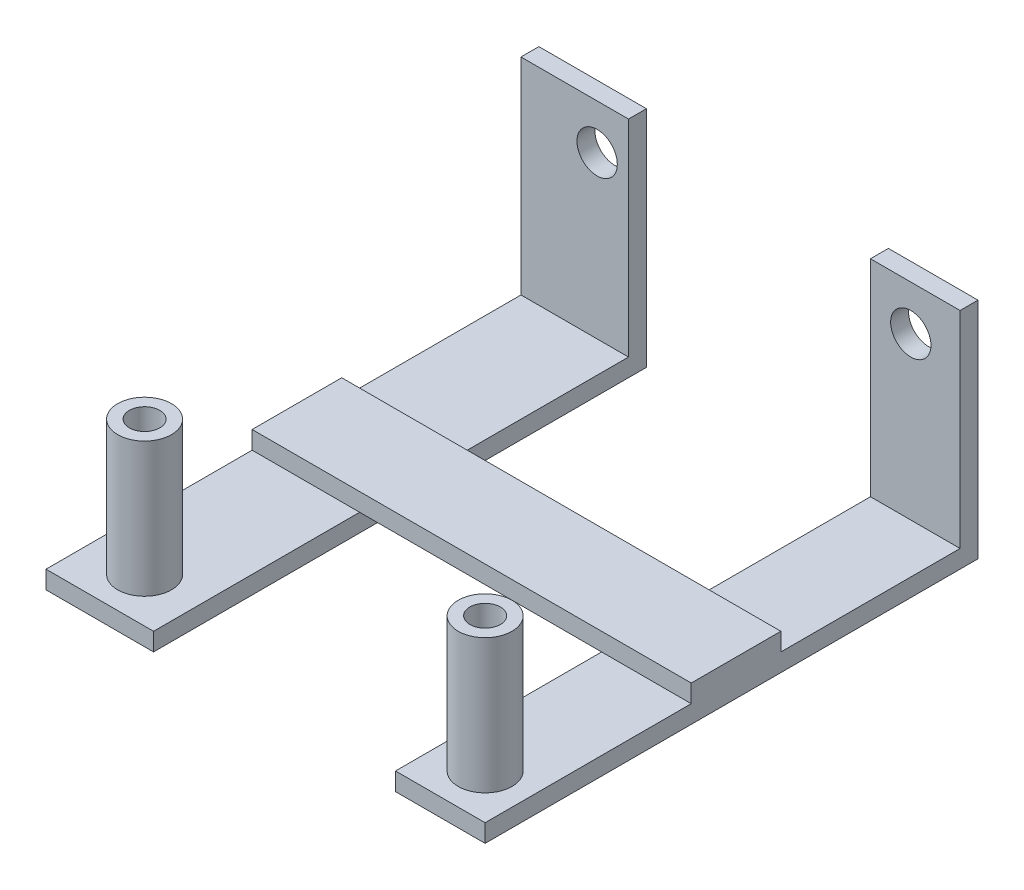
ISO-10303-21;
HEADER;
FILE_DESCRIPTION(('STEP AP214'),'2;1');
FILE_NAME('part.step','',(''),(''),'','','');
FILE_SCHEMA(('AUTOMOTIVE_DESIGN { 1 0 10303 214 1 1 1 1 }'));
ENDSEC;
DATA;
#1=APPLICATION_CONTEXT('core data for automotive mechanical design processes');
#2=APPLICATION_PROTOCOL_DEFINITION('international standard','automotive_design',2000,#1);
#3=PRODUCT_CONTEXT('',#1,'mechanical');
#4=PRODUCT('Part','Part','',(#3));
#5=PRODUCT_RELATED_PRODUCT_CATEGORY('part','',(#4));
#6=PRODUCT_DEFINITION_FORMATION('','',#4);
#7=PRODUCT_DEFINITION_CONTEXT('part definition',#1,'design');
#8=PRODUCT_DEFINITION('design','',#6,#7);
#9=PRODUCT_DEFINITION_SHAPE('','',#8);
#10=(LENGTH_UNIT() NAMED_UNIT(*) SI_UNIT(.MILLI.,.METRE.));
#11=(NAMED_UNIT(*) PLANE_ANGLE_UNIT() SI_UNIT($,.RADIAN.));
#12=(NAMED_UNIT(*) SI_UNIT($,.STERADIAN.) SOLID_ANGLE_UNIT());
#13=UNCERTAINTY_MEASURE_WITH_UNIT(LENGTH_MEASURE(1.E-05),#10,'distance_accuracy_value','');
#14=(GEOMETRIC_REPRESENTATION_CONTEXT(3) GLOBAL_UNCERTAINTY_ASSIGNED_CONTEXT((#13)) GLOBAL_UNIT_ASSIGNED_CONTEXT((#10,
#11,#12)) REPRESENTATION_CONTEXT('',''));
#15=CARTESIAN_POINT('',(0.,0.,0.));
#16=DIRECTION('',(0.,0.,1.));
#17=DIRECTION('',(1.,0.,0.));
#18=AXIS2_PLACEMENT_3D('',#15,#16,#17);
#19=CARTESIAN_POINT('',(0.,0.,0.));
#20=DIRECTION('',(0.,1.,0.));
#21=DIRECTION('',(0.,0.,1.));
#22=AXIS2_PLACEMENT_3D('',#19,#20,#21);
#23=PLANE('',#22);
#24=DIRECTION('',(0.,0.,-1.));
#25=VECTOR('',#24,1.);
#26=CARTESIAN_POINT('',(13.,0.,5.));
#27=LINE('',#26,#25);
#28=CARTESIAN_POINT('',(13.,0.,-18.));
#29=VERTEX_POINT('',#28);
#30=CARTESIAN_POINT('',(13.,0.,-28.));
#31=VERTEX_POINT('',#30);
#32=EDGE_CURVE('E52',#29,#31,#27,.T.);
#33=ORIENTED_EDGE('',*,*,#32,.F.);
#34=DIRECTION('',(1.,0.,0.));
#35=VECTOR('',#34,1.);
#36=CARTESIAN_POINT('',(-26.,0.,-18.));
#37=LINE('',#36,#35);
#38=CARTESIAN_POINT('',(-14.,0.,-18.));
#39=VERTEX_POINT('',#38);
#40=EDGE_CURVE('E235',#39,#29,#37,.T.);
#41=ORIENTED_EDGE('',*,*,#40,.F.);
#42=DIRECTION('',(0.,0.,1.));
#43=VECTOR('',#42,1.);
#44=CARTESIAN_POINT('',(-14.,0.,5.));
#45=LINE('',#44,#43);
#46=CARTESIAN_POINT('',(-14.,0.,-28.));
#47=VERTEX_POINT('',#46);
#48=EDGE_CURVE('E316',#47,#39,#45,.T.);
#49=ORIENTED_EDGE('',*,*,#48,.F.);
#50=DIRECTION('',(-1.,0.,0.));
#51=VECTOR('',#50,1.);
#52=CARTESIAN_POINT('',(-26.,0.,-28.));
#53=LINE('',#52,#51);
#54=EDGE_CURVE('E250',#31,#47,#53,.T.);
#55=ORIENTED_EDGE('',*,*,#54,.F.);
#56=EDGE_LOOP('',(#33,#41,#49,#55));
#57=FACE_BOUND('',#56,.T.);
#58=ADVANCED_FACE('F37',(#57),#23,.F.);
#59=CARTESIAN_POINT('',(0.,0.,0.));
#60=DIRECTION('',(0.,-1.,0.));
#61=DIRECTION('',(0.,0.,-1.));
#62=AXIS2_PLACEMENT_3D('',#59,#60,#61);
#63=PLANE('',#62);
#64=CARTESIAN_POINT('',(-20.,0.,0.));
#65=DIRECTION('',(0.,1.,0.));
#66=DIRECTION('',(0.,0.,1.));
#67=AXIS2_PLACEMENT_3D('',#64,#65,#66);
#68=CIRCLE('',#67,3.);
#69=CARTESIAN_POINT('',(-20.,0.,3.));
#70=VERTEX_POINT('',#69);
#71=EDGE_CURVE('E323',#70,#70,#68,.T.);
#72=ORIENTED_EDGE('',*,*,#71,.F.);
#73=EDGE_LOOP('',(#72));
#74=FACE_BOUND('',#73,.T.);
#75=CARTESIAN_POINT('',(-26.,0.,-18.));
#76=VERTEX_POINT('',#75);
#77=EDGE_CURVE('E247',#76,#39,#37,.T.);
#78=ORIENTED_EDGE('',*,*,#77,.F.);
#79=DIRECTION('',(0.,0.,-1.));
#80=VECTOR('',#79,1.);
#81=CARTESIAN_POINT('',(-26.,0.,5.));
#82=LINE('',#81,#80);
#83=CARTESIAN_POINT('',(-26.,0.,5.));
#84=VERTEX_POINT('',#83);
#85=EDGE_CURVE('E307',#84,#76,#82,.T.);
#86=ORIENTED_EDGE('',*,*,#85,.F.);
#87=DIRECTION('',(-1.,0.,0.));
#88=VECTOR('',#87,1.);
#89=CARTESIAN_POINT('',(-26.,0.,5.));
#90=LINE('',#89,#88);
#91=CARTESIAN_POINT('',(-14.,0.,5.));
#92=VERTEX_POINT('',#91);
#93=EDGE_CURVE('E302',#92,#84,#90,.T.);
#94=ORIENTED_EDGE('',*,*,#93,.F.);
#95=EDGE_CURVE('E60',#39,#92,#45,.T.);
#96=ORIENTED_EDGE('',*,*,#95,.F.);
#97=EDGE_LOOP('',(#78,#86,#94,#96));
#98=FACE_BOUND('',#97,.T.);
#99=ADVANCED_FACE('F329',(#74,#98),#63,.F.);
#100=DIRECTION('',(-1.,0.,0.));
#101=VECTOR('',#100,1.);
#102=CARTESIAN_POINT('',(0.,0.,-28.));
#103=LINE('',#102,#101);
#104=CARTESIAN_POINT('',(-26.,0.,-28.));
#105=VERTEX_POINT('',#104);
#106=EDGE_CURVE('E11',#47,#105,#103,.T.);
#107=ORIENTED_EDGE('',*,*,#106,.F.);
#108=CARTESIAN_POINT('',(-14.,0.,-48.));
#109=VERTEX_POINT('',#108);
#110=EDGE_CURVE('E313',#109,#47,#45,.T.);
#111=ORIENTED_EDGE('',*,*,#110,.F.);
#112=DIRECTION('',(1.,0.,0.));
#113=VECTOR('',#112,1.);
#114=CARTESIAN_POINT('',(-26.,0.,-48.));
#115=LINE('',#114,#113);
#116=CARTESIAN_POINT('',(-26.,0.,-48.));
#117=VERTEX_POINT('',#116);
#118=EDGE_CURVE('E310',#117,#109,#115,.T.);
#119=ORIENTED_EDGE('',*,*,#118,.F.);
#120=EDGE_CURVE('E290',#105,#117,#82,.T.);
#121=ORIENTED_EDGE('',*,*,#120,.F.);
#122=EDGE_LOOP('',(#107,#111,#119,#121));
#123=FACE_BOUND('',#122,.T.);
#124=ADVANCED_FACE('F331',(#123),#63,.F.);
#125=CARTESIAN_POINT('',(0.,0.,-50.));
#126=DIRECTION('',(0.,0.,1.));
#127=DIRECTION('',(1.,0.,0.));
#128=AXIS2_PLACEMENT_3D('',#125,#126,#127);
#129=PLANE('',#128);
#130=DIRECTION('',(0.,-1.,0.));
#131=VECTOR('',#130,1.);
#132=CARTESIAN_POINT('',(-14.,-2.,-50.));
#133=LINE('',#132,#131);
#134=CARTESIAN_POINT('',(-14.,23.,-50.));
#135=VERTEX_POINT('',#134);
#136=CARTESIAN_POINT('',(-14.,-2.,-50.));
#137=VERTEX_POINT('',#136);
#138=EDGE_CURVE('E285',#135,#137,#133,.T.);
#139=ORIENTED_EDGE('',*,*,#138,.T.);
#140=DIRECTION('',(-1.,0.,0.));
#141=VECTOR('',#140,1.);
#142=CARTESIAN_POINT('',(-14.,-2.,-50.));
#143=LINE('',#142,#141);
#144=CARTESIAN_POINT('',(-26.,-2.,-50.));
#145=VERTEX_POINT('',#144);
#146=EDGE_CURVE('E294',#137,#145,#143,.T.);
#147=ORIENTED_EDGE('',*,*,#146,.T.);
#148=DIRECTION('',(0.,1.,0.));
#149=VECTOR('',#148,1.);
#150=CARTESIAN_POINT('',(-26.,-2.,-50.));
#151=LINE('',#150,#149);
#152=CARTESIAN_POINT('',(-26.,23.,-50.));
#153=VERTEX_POINT('',#152);
#154=EDGE_CURVE('E292',#145,#153,#151,.T.);
#155=ORIENTED_EDGE('',*,*,#154,.T.);
#156=DIRECTION('',(1.,0.,0.));
#157=VECTOR('',#156,1.);
#158=CARTESIAN_POINT('',(-14.,23.,-50.));
#159=LINE('',#158,#157);
#160=EDGE_CURVE('E281',#153,#135,#159,.T.);
#161=ORIENTED_EDGE('',*,*,#160,.T.);
#162=EDGE_LOOP('',(#139,#147,#155,#161));
#163=FACE_BOUND('',#162,.T.);
#164=CARTESIAN_POINT('',(-17.5,18.,-50.));
#165=DIRECTION('',(0.,0.,-1.));
#166=DIRECTION('',(-1.,0.,0.));
#167=AXIS2_PLACEMENT_3D('',#164,#165,#166);
#168=CIRCLE('',#167,2.24999999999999);
#169=CARTESIAN_POINT('',(-19.75,18.,-50.));
#170=VERTEX_POINT('',#169);
#171=EDGE_CURVE('E269',#170,#170,#168,.T.);
#172=ORIENTED_EDGE('',*,*,#171,.F.);
#173=EDGE_LOOP('',(#172));
#174=FACE_BOUND('',#173,.T.);
#175=ADVANCED_FACE('F372',(#163,#174),#129,.F.);
#176=CARTESIAN_POINT('',(-20.,15.,0.));
#177=DIRECTION('',(0.,-1.,0.));
#178=DIRECTION('',(0.,0.,-1.));
#179=AXIS2_PLACEMENT_3D('',#176,#177,#178);
#180=CYLINDRICAL_SURFACE('',#179,3.);
#181=CARTESIAN_POINT('',(-20.,15.,0.));
#182=DIRECTION('',(0.,1.,0.));
#183=DIRECTION('',(0.,0.,1.));
#184=AXIS2_PLACEMENT_3D('',#181,#182,#183);
#185=CIRCLE('',#184,3.);
#186=CARTESIAN_POINT('',(-20.,15.,3.));
#187=VERTEX_POINT('',#186);
#188=EDGE_CURVE('E45',#187,#187,#185,.T.);
#189=ORIENTED_EDGE('',*,*,#188,.F.);
#190=EDGE_LOOP('',(#189));
#191=FACE_BOUND('',#190,.T.);
#192=ORIENTED_EDGE('',*,*,#71,.T.);
#193=EDGE_LOOP('',(#192));
#194=FACE_BOUND('',#193,.T.);
#195=ADVANCED_FACE('F39',(#191,#194),#180,.T.);
#196=CARTESIAN_POINT('',(-20.,15.,0.));
#197=DIRECTION('',(0.,1.,0.));
#198=DIRECTION('',(0.,0.,1.));
#199=AXIS2_PLACEMENT_3D('',#196,#197,#198);
#200=PLANE('',#199);
#201=CARTESIAN_POINT('',(-20.,15.,0.));
#202=DIRECTION('',(0.,1.,0.));
#203=DIRECTION('',(0.,0.,1.));
#204=AXIS2_PLACEMENT_3D('',#201,#202,#203);
#205=CIRCLE('',#204,1.7);
#206=CARTESIAN_POINT('',(-20.,15.,1.7));
#207=VERTEX_POINT('',#206);
#208=EDGE_CURVE('E263',#207,#207,#205,.T.);
#209=ORIENTED_EDGE('',*,*,#208,.F.);
#210=EDGE_LOOP('',(#209));
#211=FACE_BOUND('',#210,.T.);
#212=ORIENTED_EDGE('',*,*,#188,.T.);
#213=EDGE_LOOP('',(#212));
#214=FACE_BOUND('',#213,.T.);
#215=ADVANCED_FACE('F428',(#211,#214),#200,.T.);
#216=CARTESIAN_POINT('',(-26.,-2.,5.));
#217=DIRECTION('',(1.,0.,0.));
#218=DIRECTION('',(0.,0.,-1.));
#219=AXIS2_PLACEMENT_3D('',#216,#217,#218);
#220=PLANE('',#219);
#221=ORIENTED_EDGE('',*,*,#85,.T.);
#222=DIRECTION('',(0.,-1.,0.));
#223=VECTOR('',#222,1.);
#224=CARTESIAN_POINT('',(-26.,2.,-18.));
#225=LINE('',#224,#223);
#226=CARTESIAN_POINT('',(-26.,2.,-18.));
#227=VERTEX_POINT('',#226);
#228=EDGE_CURVE('E260',#227,#76,#225,.T.);
#229=ORIENTED_EDGE('',*,*,#228,.F.);
#230=DIRECTION('',(0.,0.,1.));
#231=VECTOR('',#230,1.);
#232=CARTESIAN_POINT('',(-26.,2.,-28.));
#233=LINE('',#232,#231);
#234=CARTESIAN_POINT('',(-26.,2.,-28.));
#235=VERTEX_POINT('',#234);
#236=EDGE_CURVE('E236',#235,#227,#233,.T.);
#237=ORIENTED_EDGE('',*,*,#236,.F.);
#238=DIRECTION('',(0.,-1.,0.));
#239=VECTOR('',#238,1.);
#240=CARTESIAN_POINT('',(-26.,2.,-28.));
#241=LINE('',#240,#239);
#242=EDGE_CURVE('E246',#235,#105,#241,.T.);
#243=ORIENTED_EDGE('',*,*,#242,.T.);
#244=ORIENTED_EDGE('',*,*,#120,.T.);
#245=DIRECTION('',(0.,1.,0.));
#246=VECTOR('',#245,1.);
#247=CARTESIAN_POINT('',(-26.,-2.,-48.));
#248=LINE('',#247,#246);
#249=CARTESIAN_POINT('',(-26.,23.,-48.));
#250=VERTEX_POINT('',#249);
#251=EDGE_CURVE('E284',#117,#250,#248,.T.);
#252=ORIENTED_EDGE('',*,*,#251,.T.);
#253=DIRECTION('',(0.,0.,1.));
#254=VECTOR('',#253,1.);
#255=CARTESIAN_POINT('',(-26.,23.,-50.));
#256=LINE('',#255,#254);
#257=EDGE_CURVE('E275',#153,#250,#256,.T.);
#258=ORIENTED_EDGE('',*,*,#257,.F.);
#259=ORIENTED_EDGE('',*,*,#154,.F.);
#260=DIRECTION('',(0.,0.,-1.));
#261=VECTOR('',#260,1.);
#262=CARTESIAN_POINT('',(-26.,-2.,5.));
#263=LINE('',#262,#261);
#264=CARTESIAN_POINT('',(-26.,-2.,5.));
#265=VERTEX_POINT('',#264);
#266=EDGE_CURVE('E299',#265,#145,#263,.T.);
#267=ORIENTED_EDGE('',*,*,#266,.F.);
#268=DIRECTION('',(0.,1.,0.));
#269=VECTOR('',#268,1.);
#270=CARTESIAN_POINT('',(-26.,-2.,5.));
#271=LINE('',#270,#269);
#272=EDGE_CURVE('E306',#265,#84,#271,.T.);
#273=ORIENTED_EDGE('',*,*,#272,.T.);
#274=EDGE_LOOP('',(#221,#229,#237,#243,#244,#252,#258,#259,#267,#273));
#275=FACE_BOUND('',#274,.T.);
#276=ADVANCED_FACE('F338',(#275),#220,.F.);
#277=CARTESIAN_POINT('',(-14.,-2.,5.));
#278=DIRECTION('',(-1.,0.,0.));
#279=DIRECTION('',(0.,0.,1.));
#280=AXIS2_PLACEMENT_3D('',#277,#278,#279);
#281=PLANE('',#280);
#282=ORIENTED_EDGE('',*,*,#110,.T.);
#283=ORIENTED_EDGE('',*,*,#48,.T.);
#284=ORIENTED_EDGE('',*,*,#95,.T.);
#285=DIRECTION('',(0.,1.,0.));
#286=VECTOR('',#285,1.);
#287=CARTESIAN_POINT('',(-14.,-2.,5.));
#288=LINE('',#287,#286);
#289=CARTESIAN_POINT('',(-14.,-2.,5.));
#290=VERTEX_POINT('',#289);
#291=EDGE_CURVE('E320',#290,#92,#288,.T.);
#292=ORIENTED_EDGE('',*,*,#291,.F.);
#293=DIRECTION('',(0.,0.,1.));
#294=VECTOR('',#293,1.);
#295=CARTESIAN_POINT('',(-14.,-2.,5.));
#296=LINE('',#295,#294);
#297=EDGE_CURVE('E301',#137,#290,#296,.T.);
#298=ORIENTED_EDGE('',*,*,#297,.F.);
#299=ORIENTED_EDGE('',*,*,#138,.F.);
#300=DIRECTION('',(0.,0.,1.));
#301=VECTOR('',#300,1.);
#302=CARTESIAN_POINT('',(-14.,23.,-50.));
#303=LINE('',#302,#301);
#304=CARTESIAN_POINT('',(-14.,23.,-48.));
#305=VERTEX_POINT('',#304);
#306=EDGE_CURVE('E278',#135,#305,#303,.T.);
#307=ORIENTED_EDGE('',*,*,#306,.T.);
#308=DIRECTION('',(0.,-1.,0.));
#309=VECTOR('',#308,1.);
#310=CARTESIAN_POINT('',(-14.,-2.,-48.));
#311=LINE('',#310,#309);
#312=EDGE_CURVE('E287',#305,#109,#311,.T.);
#313=ORIENTED_EDGE('',*,*,#312,.T.);
#314=EDGE_LOOP('',(#282,#283,#284,#292,#298,#299,#307,#313));
#315=FACE_BOUND('',#314,.T.);
#316=ADVANCED_FACE('F358',(#315),#281,.F.);
#317=CARTESIAN_POINT('',(-26.,-2.,5.));
#318=DIRECTION('',(0.,0.,-1.));
#319=DIRECTION('',(-1.,0.,0.));
#320=AXIS2_PLACEMENT_3D('',#317,#318,#319);
#321=PLANE('',#320);
#322=ORIENTED_EDGE('',*,*,#93,.T.);
#323=ORIENTED_EDGE('',*,*,#272,.F.);
#324=DIRECTION('',(-1.,0.,0.));
#325=VECTOR('',#324,1.);
#326=CARTESIAN_POINT('',(-26.,-2.,5.));
#327=LINE('',#326,#325);
#328=EDGE_CURVE('E304',#290,#265,#327,.T.);
#329=ORIENTED_EDGE('',*,*,#328,.F.);
#330=ORIENTED_EDGE('',*,*,#291,.T.);
#331=EDGE_LOOP('',(#322,#323,#329,#330));
#332=FACE_BOUND('',#331,.T.);
#333=ADVANCED_FACE('F365',(#332),#321,.F.);
#334=CARTESIAN_POINT('',(0.,-2.,0.));
#335=DIRECTION('',(0.,-1.,0.));
#336=DIRECTION('',(0.,0.,-1.));
#337=AXIS2_PLACEMENT_3D('',#334,#335,#336);
#338=PLANE('',#337);
#339=CARTESIAN_POINT('',(-20.,-2.,0.));
#340=DIRECTION('',(0.,-1.,0.));
#341=DIRECTION('',(0.,0.,-1.));
#342=AXIS2_PLACEMENT_3D('',#339,#340,#341);
#343=CIRCLE('',#342,1.7);
#344=CARTESIAN_POINT('',(-20.,-2.,-1.7));
#345=VERTEX_POINT('',#344);
#346=EDGE_CURVE('E266',#345,#345,#343,.T.);
#347=ORIENTED_EDGE('',*,*,#346,.F.);
#348=EDGE_LOOP('',(#347));
#349=FACE_BOUND('',#348,.T.);
#350=ORIENTED_EDGE('',*,*,#266,.T.);
#351=ORIENTED_EDGE('',*,*,#146,.F.);
#352=ORIENTED_EDGE('',*,*,#297,.T.);
#353=ORIENTED_EDGE('',*,*,#328,.T.);
#354=EDGE_LOOP('',(#350,#351,#352,#353));
#355=FACE_BOUND('',#354,.T.);
#356=ADVANCED_FACE('F367',(#349,#355),#338,.T.);
#357=CARTESIAN_POINT('',(-14.,23.,-50.));
#358=DIRECTION('',(0.,-1.,0.));
#359=DIRECTION('',(0.,0.,-1.));
#360=AXIS2_PLACEMENT_3D('',#357,#358,#359);
#361=PLANE('',#360);
#362=DIRECTION('',(1.,0.,0.));
#363=VECTOR('',#362,1.);
#364=CARTESIAN_POINT('',(-14.,23.,-48.));
#365=LINE('',#364,#363);
#366=EDGE_CURVE('E282',#250,#305,#365,.T.);
#367=ORIENTED_EDGE('',*,*,#366,.T.);
#368=ORIENTED_EDGE('',*,*,#306,.F.);
#369=ORIENTED_EDGE('',*,*,#160,.F.);
#370=ORIENTED_EDGE('',*,*,#257,.T.);
#371=EDGE_LOOP('',(#367,#368,#369,#370));
#372=FACE_BOUND('',#371,.T.);
#373=ADVANCED_FACE('F378',(#372),#361,.F.);
#374=CARTESIAN_POINT('',(0.,0.,-48.));
#375=DIRECTION('',(0.,0.,1.));
#376=DIRECTION('',(1.,0.,0.));
#377=AXIS2_PLACEMENT_3D('',#374,#375,#376);
#378=PLANE('',#377);
#379=CARTESIAN_POINT('',(-17.5,18.,-48.));
#380=DIRECTION('',(0.,0.,1.));
#381=DIRECTION('',(1.,0.,0.));
#382=AXIS2_PLACEMENT_3D('',#379,#380,#381);
#383=CIRCLE('',#382,2.24999999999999);
#384=CARTESIAN_POINT('',(-15.25,18.,-48.));
#385=VERTEX_POINT('',#384);
#386=EDGE_CURVE('E272',#385,#385,#383,.T.);
#387=ORIENTED_EDGE('',*,*,#386,.F.);
#388=EDGE_LOOP('',(#387));
#389=FACE_BOUND('',#388,.T.);
#390=ORIENTED_EDGE('',*,*,#251,.F.);
#391=ORIENTED_EDGE('',*,*,#118,.T.);
#392=ORIENTED_EDGE('',*,*,#312,.F.);
#393=ORIENTED_EDGE('',*,*,#366,.F.);
#394=EDGE_LOOP('',(#390,#391,#392,#393));
#395=FACE_BOUND('',#394,.T.);
#396=ADVANCED_FACE('F382',(#389,#395),#378,.T.);
#397=CARTESIAN_POINT('',(-17.5,18.,-50.));
#398=DIRECTION('',(0.,0.,-1.));
#399=DIRECTION('',(-1.,0.,0.));
#400=AXIS2_PLACEMENT_3D('',#397,#398,#399);
#401=CYLINDRICAL_SURFACE('',#400,2.24999999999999);
#402=ORIENTED_EDGE('',*,*,#171,.T.);
#403=EDGE_LOOP('',(#402));
#404=FACE_BOUND('',#403,.T.);
#405=ORIENTED_EDGE('',*,*,#386,.T.);
#406=EDGE_LOOP('',(#405));
#407=FACE_BOUND('',#406,.T.);
#408=ADVANCED_FACE('F384',(#404,#407),#401,.F.);
#409=CARTESIAN_POINT('',(-20.,15.,0.));
#410=DIRECTION('',(0.,1.,0.));
#411=DIRECTION('',(0.,0.,1.));
#412=AXIS2_PLACEMENT_3D('',#409,#410,#411);
#413=CYLINDRICAL_SURFACE('',#412,1.7);
#414=ORIENTED_EDGE('',*,*,#208,.T.);
#415=EDGE_LOOP('',(#414));
#416=FACE_BOUND('',#415,.T.);
#417=ORIENTED_EDGE('',*,*,#346,.T.);
#418=EDGE_LOOP('',(#417));
#419=FACE_BOUND('',#418,.T.);
#420=ADVANCED_FACE('F391',(#416,#419),#413,.F.);
#421=CARTESIAN_POINT('',(-26.,2.,-18.));
#422=DIRECTION('',(0.,0.,-1.));
#423=DIRECTION('',(-1.,0.,0.));
#424=AXIS2_PLACEMENT_3D('',#421,#422,#423);
#425=PLANE('',#424);
#426=ORIENTED_EDGE('',*,*,#77,.T.);
#427=ORIENTED_EDGE('',*,*,#40,.T.);
#428=DIRECTION('',(-1.,0.,0.));
#429=VECTOR('',#428,1.);
#430=CARTESIAN_POINT('',(-26.,0.,-18.));
#431=LINE('',#430,#429);
#432=CARTESIAN_POINT('',(23.,0.,-18.));
#433=VERTEX_POINT('',#432);
#434=EDGE_CURVE('E233',#433,#29,#431,.T.);
#435=ORIENTED_EDGE('',*,*,#434,.F.);
#436=DIRECTION('',(0.,-1.,0.));
#437=VECTOR('',#436,1.);
#438=CARTESIAN_POINT('',(23.,2.,-18.));
#439=LINE('',#438,#437);
#440=CARTESIAN_POINT('',(23.,2.,-18.));
#441=VERTEX_POINT('',#440);
#442=EDGE_CURVE('E258',#441,#433,#439,.T.);
#443=ORIENTED_EDGE('',*,*,#442,.F.);
#444=DIRECTION('',(1.,0.,0.));
#445=VECTOR('',#444,1.);
#446=CARTESIAN_POINT('',(-26.,2.,-18.));
#447=LINE('',#446,#445);
#448=EDGE_CURVE('E239',#227,#441,#447,.T.);
#449=ORIENTED_EDGE('',*,*,#448,.F.);
#450=ORIENTED_EDGE('',*,*,#228,.T.);
#451=EDGE_LOOP('',(#426,#427,#435,#443,#449,#450));
#452=FACE_BOUND('',#451,.T.);
#453=ADVANCED_FACE('F342',(#452),#425,.F.);
#454=CARTESIAN_POINT('',(23.,2.,-28.));
#455=DIRECTION('',(-1.,0.,0.));
#456=DIRECTION('',(0.,0.,1.));
#457=AXIS2_PLACEMENT_3D('',#454,#455,#456);
#458=PLANE('',#457);
#459=ORIENTED_EDGE('',*,*,#442,.T.);
#460=DIRECTION('',(0.,0.,1.));
#461=VECTOR('',#460,1.);
#462=CARTESIAN_POINT('',(23.,0.,5.));
#463=LINE('',#462,#461);
#464=CARTESIAN_POINT('',(23.,0.,5.));
#465=VERTEX_POINT('',#464);
#466=EDGE_CURVE('E215',#433,#465,#463,.T.);
#467=ORIENTED_EDGE('',*,*,#466,.T.);
#468=DIRECTION('',(0.,1.,0.));
#469=VECTOR('',#468,1.);
#470=CARTESIAN_POINT('',(23.,-2.,5.));
#471=LINE('',#470,#469);
#472=CARTESIAN_POINT('',(23.,-2.,5.));
#473=VERTEX_POINT('',#472);
#474=EDGE_CURVE('E171',#473,#465,#471,.T.);
#475=ORIENTED_EDGE('',*,*,#474,.F.);
#476=DIRECTION('',(0.,0.,1.));
#477=VECTOR('',#476,1.);
#478=CARTESIAN_POINT('',(23.,-2.,5.));
#479=LINE('',#478,#477);
#480=CARTESIAN_POINT('',(23.,-2.,-50.));
#481=VERTEX_POINT('',#480);
#482=EDGE_CURVE('E163',#481,#473,#479,.T.);
#483=ORIENTED_EDGE('',*,*,#482,.F.);
#484=DIRECTION('',(0.,-1.,0.));
#485=VECTOR('',#484,1.);
#486=CARTESIAN_POINT('',(23.,-2.,-50.));
#487=LINE('',#486,#485);
#488=CARTESIAN_POINT('',(23.,23.,-50.));
#489=VERTEX_POINT('',#488);
#490=EDGE_CURVE('E169',#489,#481,#487,.T.);
#491=ORIENTED_EDGE('',*,*,#490,.F.);
#492=DIRECTION('',(0.,0.,1.));
#493=VECTOR('',#492,1.);
#494=CARTESIAN_POINT('',(23.,23.,-50.));
#495=LINE('',#494,#493);
#496=CARTESIAN_POINT('',(23.,23.,-48.));
#497=VERTEX_POINT('',#496);
#498=EDGE_CURVE('E200',#489,#497,#495,.T.);
#499=ORIENTED_EDGE('',*,*,#498,.T.);
#500=DIRECTION('',(0.,-1.,0.));
#501=VECTOR('',#500,1.);
#502=CARTESIAN_POINT('',(23.,-2.,-48.));
#503=LINE('',#502,#501);
#504=CARTESIAN_POINT('',(23.,0.,-48.));
#505=VERTEX_POINT('',#504);
#506=EDGE_CURVE('E201',#497,#505,#503,.T.);
#507=ORIENTED_EDGE('',*,*,#506,.T.);
#508=CARTESIAN_POINT('',(23.,0.,-28.));
#509=VERTEX_POINT('',#508);
#510=EDGE_CURVE('E216',#505,#509,#463,.T.);
#511=ORIENTED_EDGE('',*,*,#510,.T.);
#512=DIRECTION('',(0.,-1.,0.));
#513=VECTOR('',#512,1.);
#514=CARTESIAN_POINT('',(23.,2.,-28.));
#515=LINE('',#514,#513);
#516=CARTESIAN_POINT('',(23.,2.,-28.));
#517=VERTEX_POINT('',#516);
#518=EDGE_CURVE('E255',#517,#509,#515,.T.);
#519=ORIENTED_EDGE('',*,*,#518,.F.);
#520=DIRECTION('',(0.,0.,-1.));
#521=VECTOR('',#520,1.);
#522=CARTESIAN_POINT('',(23.,2.,-28.));
#523=LINE('',#522,#521);
#524=EDGE_CURVE('E242',#441,#517,#523,.T.);
#525=ORIENTED_EDGE('',*,*,#524,.F.);
#526=EDGE_LOOP('',(#459,#467,#475,#483,#491,#499,#507,#511,#519,#525));
#527=FACE_BOUND('',#526,.T.);
#528=ADVANCED_FACE('F166',(#527),#458,.F.);
#529=CARTESIAN_POINT('',(-26.,2.,-28.));
#530=DIRECTION('',(0.,0.,1.));
#531=DIRECTION('',(1.,0.,0.));
#532=AXIS2_PLACEMENT_3D('',#529,#530,#531);
#533=PLANE('',#532);
#534=EDGE_CURVE('E240',#509,#31,#53,.T.);
#535=ORIENTED_EDGE('',*,*,#534,.T.);
#536=ORIENTED_EDGE('',*,*,#54,.T.);
#537=ORIENTED_EDGE('',*,*,#106,.T.);
#538=ORIENTED_EDGE('',*,*,#242,.F.);
#539=DIRECTION('',(-1.,0.,0.));
#540=VECTOR('',#539,1.);
#541=CARTESIAN_POINT('',(-26.,2.,-28.));
#542=LINE('',#541,#540);
#543=EDGE_CURVE('E244',#517,#235,#542,.T.);
#544=ORIENTED_EDGE('',*,*,#543,.F.);
#545=ORIENTED_EDGE('',*,*,#518,.T.);
#546=EDGE_LOOP('',(#535,#536,#537,#538,#544,#545));
#547=FACE_BOUND('',#546,.T.);
#548=ADVANCED_FACE('F352',(#547),#533,.F.);
#549=CARTESIAN_POINT('',(0.,2.,0.));
#550=DIRECTION('',(0.,1.,0.));
#551=DIRECTION('',(0.,0.,1.));
#552=AXIS2_PLACEMENT_3D('',#549,#550,#551);
#553=PLANE('',#552);
#554=ORIENTED_EDGE('',*,*,#236,.T.);
#555=ORIENTED_EDGE('',*,*,#448,.T.);
#556=ORIENTED_EDGE('',*,*,#524,.T.);
#557=ORIENTED_EDGE('',*,*,#543,.T.);
#558=EDGE_LOOP('',(#554,#555,#556,#557));
#559=FACE_BOUND('',#558,.T.);
#560=ADVANCED_FACE('F347',(#559),#553,.T.);
#561=CARTESIAN_POINT('',(0.,0.,0.));
#562=DIRECTION('',(0.,-1.,0.));
#563=DIRECTION('',(0.,0.,-1.));
#564=AXIS2_PLACEMENT_3D('',#561,#562,#563);
#565=PLANE('',#564);
#566=CARTESIAN_POINT('',(18.,0.,0.));
#567=DIRECTION('',(0.,1.,0.));
#568=DIRECTION('',(0.,0.,1.));
#569=AXIS2_PLACEMENT_3D('',#566,#567,#568);
#570=CIRCLE('',#569,3.);
#571=CARTESIAN_POINT('',(18.,0.,3.));
#572=VERTEX_POINT('',#571);
#573=EDGE_CURVE('E225',#572,#572,#570,.T.);
#574=ORIENTED_EDGE('',*,*,#573,.F.);
#575=EDGE_LOOP('',(#574));
#576=FACE_BOUND('',#575,.T.);
#577=ORIENTED_EDGE('',*,*,#466,.F.);
#578=ORIENTED_EDGE('',*,*,#434,.T.);
#579=CARTESIAN_POINT('',(13.,0.,5.));
#580=VERTEX_POINT('',#579);
#581=EDGE_CURVE('E223',#580,#29,#27,.T.);
#582=ORIENTED_EDGE('',*,*,#581,.F.);
#583=DIRECTION('',(-1.,0.,0.));
#584=VECTOR('',#583,1.);
#585=CARTESIAN_POINT('',(13.,0.,5.));
#586=LINE('',#585,#584);
#587=EDGE_CURVE('E213',#465,#580,#586,.T.);
#588=ORIENTED_EDGE('',*,*,#587,.F.);
#589=EDGE_LOOP('',(#577,#578,#582,#588));
#590=FACE_BOUND('',#589,.T.);
#591=ADVANCED_FACE('F569',(#576,#590),#565,.F.);
#592=CARTESIAN_POINT('',(13.,0.,-48.));
#593=VERTEX_POINT('',#592);
#594=EDGE_CURVE('E222',#31,#593,#27,.T.);
#595=ORIENTED_EDGE('',*,*,#594,.F.);
#596=ORIENTED_EDGE('',*,*,#534,.F.);
#597=ORIENTED_EDGE('',*,*,#510,.F.);
#598=DIRECTION('',(1.,0.,0.));
#599=VECTOR('',#598,1.);
#600=CARTESIAN_POINT('',(13.,0.,-48.));
#601=LINE('',#600,#599);
#602=EDGE_CURVE('E219',#593,#505,#601,.T.);
#603=ORIENTED_EDGE('',*,*,#602,.F.);
#604=EDGE_LOOP('',(#595,#596,#597,#603));
#605=FACE_BOUND('',#604,.T.);
#606=ADVANCED_FACE('F578',(#605),#565,.F.);
#607=CARTESIAN_POINT('',(0.,0.,-50.));
#608=DIRECTION('',(0.,0.,1.));
#609=DIRECTION('',(1.,0.,0.));
#610=AXIS2_PLACEMENT_3D('',#607,#608,#609);
#611=PLANE('',#610);
#612=ORIENTED_EDGE('',*,*,#490,.T.);
#613=DIRECTION('',(-1.,0.,0.));
#614=VECTOR('',#613,1.);
#615=CARTESIAN_POINT('',(23.,-2.,-50.));
#616=LINE('',#615,#614);
#617=CARTESIAN_POINT('',(13.,-2.,-50.));
#618=VERTEX_POINT('',#617);
#619=EDGE_CURVE('E178',#481,#618,#616,.T.);
#620=ORIENTED_EDGE('',*,*,#619,.T.);
#621=DIRECTION('',(0.,1.,0.));
#622=VECTOR('',#621,1.);
#623=CARTESIAN_POINT('',(13.,-2.,-50.));
#624=LINE('',#623,#622);
#625=CARTESIAN_POINT('',(13.,23.,-50.));
#626=VERTEX_POINT('',#625);
#627=EDGE_CURVE('E183',#618,#626,#624,.T.);
#628=ORIENTED_EDGE('',*,*,#627,.T.);
#629=DIRECTION('',(1.,0.,0.));
#630=VECTOR('',#629,1.);
#631=CARTESIAN_POINT('',(23.,23.,-50.));
#632=LINE('',#631,#630);
#633=EDGE_CURVE('E188',#626,#489,#632,.T.);
#634=ORIENTED_EDGE('',*,*,#633,.T.);
#635=EDGE_LOOP('',(#612,#620,#628,#634));
#636=FACE_BOUND('',#635,.T.);
#637=CARTESIAN_POINT('',(17.5,18.,-50.));
#638=DIRECTION('',(0.,0.,-1.));
#639=DIRECTION('',(-1.,0.,0.));
#640=AXIS2_PLACEMENT_3D('',#637,#638,#639);
#641=CIRCLE('',#640,2.24999999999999);
#642=CARTESIAN_POINT('',(15.25,18.,-50.));
#643=VERTEX_POINT('',#642);
#644=EDGE_CURVE('E730',#643,#643,#641,.T.);
#645=ORIENTED_EDGE('',*,*,#644,.F.);
#646=EDGE_LOOP('',(#645));
#647=FACE_BOUND('',#646,.T.);
#648=ADVANCED_FACE('F185',(#636,#647),#611,.F.);
#649=CARTESIAN_POINT('',(18.,15.,0.));
#650=DIRECTION('',(0.,-1.,0.));
#651=DIRECTION('',(0.,0.,-1.));
#652=AXIS2_PLACEMENT_3D('',#649,#650,#651);
#653=CYLINDRICAL_SURFACE('',#652,3.);
#654=CARTESIAN_POINT('',(18.,15.,0.));
#655=DIRECTION('',(0.,1.,0.));
#656=DIRECTION('',(0.,0.,1.));
#657=AXIS2_PLACEMENT_3D('',#654,#655,#656);
#658=CIRCLE('',#657,3.);
#659=CARTESIAN_POINT('',(18.,15.,3.));
#660=VERTEX_POINT('',#659);
#661=EDGE_CURVE('E230',#660,#660,#658,.T.);
#662=ORIENTED_EDGE('',*,*,#661,.F.);
#663=EDGE_LOOP('',(#662));
#664=FACE_BOUND('',#663,.T.);
#665=ORIENTED_EDGE('',*,*,#573,.T.);
#666=EDGE_LOOP('',(#665));
#667=FACE_BOUND('',#666,.T.);
#668=ADVANCED_FACE('F597',(#664,#667),#653,.T.);
#669=CARTESIAN_POINT('',(18.,15.,0.));
#670=DIRECTION('',(0.,1.,0.));
#671=DIRECTION('',(0.,0.,1.));
#672=AXIS2_PLACEMENT_3D('',#669,#670,#671);
#673=PLANE('',#672);
#674=CARTESIAN_POINT('',(18.,15.,0.));
#675=DIRECTION('',(0.,1.,0.));
#676=DIRECTION('',(0.,0.,1.));
#677=AXIS2_PLACEMENT_3D('',#674,#675,#676);
#678=CIRCLE('',#677,1.7);
#679=CARTESIAN_POINT('',(18.,15.,1.7));
#680=VERTEX_POINT('',#679);
#681=EDGE_CURVE('E726',#680,#680,#678,.T.);
#682=ORIENTED_EDGE('',*,*,#681,.F.);
#683=EDGE_LOOP('',(#682));
#684=FACE_BOUND('',#683,.T.);
#685=ORIENTED_EDGE('',*,*,#661,.T.);
#686=EDGE_LOOP('',(#685));
#687=FACE_BOUND('',#686,.T.);
#688=ADVANCED_FACE('F608',(#684,#687),#673,.T.);
#689=CARTESIAN_POINT('',(13.,-2.,5.));
#690=DIRECTION('',(1.,0.,0.));
#691=DIRECTION('',(0.,0.,-1.));
#692=AXIS2_PLACEMENT_3D('',#689,#690,#691);
#693=PLANE('',#692);
#694=ORIENTED_EDGE('',*,*,#581,.T.);
#695=ORIENTED_EDGE('',*,*,#32,.T.);
#696=ORIENTED_EDGE('',*,*,#594,.T.);
#697=DIRECTION('',(0.,1.,0.));
#698=VECTOR('',#697,1.);
#699=CARTESIAN_POINT('',(13.,-2.,-48.));
#700=LINE('',#699,#698);
#701=CARTESIAN_POINT('',(13.,23.,-48.));
#702=VERTEX_POINT('',#701);
#703=EDGE_CURVE('E192',#593,#702,#700,.T.);
#704=ORIENTED_EDGE('',*,*,#703,.T.);
#705=DIRECTION('',(0.,0.,1.));
#706=VECTOR('',#705,1.);
#707=CARTESIAN_POINT('',(13.,23.,-50.));
#708=LINE('',#707,#706);
#709=EDGE_CURVE('E206',#626,#702,#708,.T.);
#710=ORIENTED_EDGE('',*,*,#709,.F.);
#711=ORIENTED_EDGE('',*,*,#627,.F.);
#712=DIRECTION('',(0.,0.,-1.));
#713=VECTOR('',#712,1.);
#714=CARTESIAN_POINT('',(13.,-2.,5.));
#715=LINE('',#714,#713);
#716=CARTESIAN_POINT('',(13.,-2.,5.));
#717=VERTEX_POINT('',#716);
#718=EDGE_CURVE('E174',#717,#618,#715,.T.);
#719=ORIENTED_EDGE('',*,*,#718,.F.);
#720=DIRECTION('',(0.,1.,0.));
#721=VECTOR('',#720,1.);
#722=CARTESIAN_POINT('',(13.,-2.,5.));
#723=LINE('',#722,#721);
#724=EDGE_CURVE('E210',#717,#580,#723,.T.);
#725=ORIENTED_EDGE('',*,*,#724,.T.);
#726=EDGE_LOOP('',(#694,#695,#696,#704,#710,#711,#719,#725));
#727=FACE_BOUND('',#726,.T.);
#728=ADVANCED_FACE('F617',(#727),#693,.F.);
#729=CARTESIAN_POINT('',(13.,-2.,5.));
#730=DIRECTION('',(0.,0.,-1.));
#731=DIRECTION('',(-1.,0.,0.));
#732=AXIS2_PLACEMENT_3D('',#729,#730,#731);
#733=PLANE('',#732);
#734=ORIENTED_EDGE('',*,*,#587,.T.);
#735=ORIENTED_EDGE('',*,*,#724,.F.);
#736=DIRECTION('',(-1.,0.,0.));
#737=VECTOR('',#736,1.);
#738=CARTESIAN_POINT('',(13.,-2.,5.));
#739=LINE('',#738,#737);
#740=EDGE_CURVE('E175',#473,#717,#739,.T.);
#741=ORIENTED_EDGE('',*,*,#740,.F.);
#742=ORIENTED_EDGE('',*,*,#474,.T.);
#743=EDGE_LOOP('',(#734,#735,#741,#742));
#744=FACE_BOUND('',#743,.T.);
#745=ADVANCED_FACE('F626',(#744),#733,.F.);
#746=CARTESIAN_POINT('',(0.,-2.,0.));
#747=DIRECTION('',(0.,-1.,0.));
#748=DIRECTION('',(0.,0.,-1.));
#749=AXIS2_PLACEMENT_3D('',#746,#747,#748);
#750=PLANE('',#749);
#751=CARTESIAN_POINT('',(18.,-2.,0.));
#752=DIRECTION('',(0.,-1.,0.));
#753=DIRECTION('',(0.,0.,-1.));
#754=AXIS2_PLACEMENT_3D('',#751,#752,#753);
#755=CIRCLE('',#754,1.7);
#756=CARTESIAN_POINT('',(18.,-2.,-1.7));
#757=VERTEX_POINT('',#756);
#758=EDGE_CURVE('E729',#757,#757,#755,.T.);
#759=ORIENTED_EDGE('',*,*,#758,.F.);
#760=EDGE_LOOP('',(#759));
#761=FACE_BOUND('',#760,.T.);
#762=ORIENTED_EDGE('',*,*,#718,.T.);
#763=ORIENTED_EDGE('',*,*,#619,.F.);
#764=ORIENTED_EDGE('',*,*,#482,.T.);
#765=ORIENTED_EDGE('',*,*,#740,.T.);
#766=EDGE_LOOP('',(#762,#763,#764,#765));
#767=FACE_BOUND('',#766,.T.);
#768=ADVANCED_FACE('F179',(#761,#767),#750,.T.);
#769=CARTESIAN_POINT('',(23.,23.,-50.));
#770=DIRECTION('',(0.,-1.,0.));
#771=DIRECTION('',(0.,0.,-1.));
#772=AXIS2_PLACEMENT_3D('',#769,#770,#771);
#773=PLANE('',#772);
#774=DIRECTION('',(1.,0.,0.));
#775=VECTOR('',#774,1.);
#776=CARTESIAN_POINT('',(23.,23.,-48.));
#777=LINE('',#776,#775);
#778=EDGE_CURVE('E190',#702,#497,#777,.T.);
#779=ORIENTED_EDGE('',*,*,#778,.T.);
#780=ORIENTED_EDGE('',*,*,#498,.F.);
#781=ORIENTED_EDGE('',*,*,#633,.F.);
#782=ORIENTED_EDGE('',*,*,#709,.T.);
#783=EDGE_LOOP('',(#779,#780,#781,#782));
#784=FACE_BOUND('',#783,.T.);
#785=ADVANCED_FACE('F644',(#784),#773,.F.);
#786=CARTESIAN_POINT('',(0.,0.,-48.));
#787=DIRECTION('',(0.,0.,1.));
#788=DIRECTION('',(1.,0.,0.));
#789=AXIS2_PLACEMENT_3D('',#786,#787,#788);
#790=PLANE('',#789);
#791=CARTESIAN_POINT('',(17.5,18.,-48.));
#792=DIRECTION('',(0.,0.,1.));
#793=DIRECTION('',(1.,0.,0.));
#794=AXIS2_PLACEMENT_3D('',#791,#792,#793);
#795=CIRCLE('',#794,2.24999999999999);
#796=CARTESIAN_POINT('',(19.75,18.,-48.));
#797=VERTEX_POINT('',#796);
#798=EDGE_CURVE('E195',#797,#797,#795,.T.);
#799=ORIENTED_EDGE('',*,*,#798,.F.);
#800=EDGE_LOOP('',(#799));
#801=FACE_BOUND('',#800,.T.);
#802=ORIENTED_EDGE('',*,*,#703,.F.);
#803=ORIENTED_EDGE('',*,*,#602,.T.);
#804=ORIENTED_EDGE('',*,*,#506,.F.);
#805=ORIENTED_EDGE('',*,*,#778,.F.);
#806=EDGE_LOOP('',(#802,#803,#804,#805));
#807=FACE_BOUND('',#806,.T.);
#808=ADVANCED_FACE('F654',(#801,#807),#790,.T.);
#809=CARTESIAN_POINT('',(17.5,18.,-50.));
#810=DIRECTION('',(0.,0.,-1.));
#811=DIRECTION('',(-1.,0.,0.));
#812=AXIS2_PLACEMENT_3D('',#809,#810,#811);
#813=CYLINDRICAL_SURFACE('',#812,2.24999999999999);
#814=ORIENTED_EDGE('',*,*,#644,.T.);
#815=EDGE_LOOP('',(#814));
#816=FACE_BOUND('',#815,.T.);
#817=ORIENTED_EDGE('',*,*,#798,.T.);
#818=EDGE_LOOP('',(#817));
#819=FACE_BOUND('',#818,.T.);
#820=ADVANCED_FACE('F664',(#816,#819),#813,.F.);
#821=CARTESIAN_POINT('',(18.,15.,0.));
#822=DIRECTION('',(0.,1.,0.));
#823=DIRECTION('',(0.,0.,1.));
#824=AXIS2_PLACEMENT_3D('',#821,#822,#823);
#825=CYLINDRICAL_SURFACE('',#824,1.7);
#826=ORIENTED_EDGE('',*,*,#681,.T.);
#827=EDGE_LOOP('',(#826));
#828=FACE_BOUND('',#827,.T.);
#829=ORIENTED_EDGE('',*,*,#758,.T.);
#830=EDGE_LOOP('',(#829));
#831=FACE_BOUND('',#830,.T.);
#832=ADVANCED_FACE('F674',(#828,#831),#825,.F.);
#833=CLOSED_SHELL('',(#58,#99,#124,#175,#195,#215,#276,#316,#333,#356,#373,#396,#408,#420,#453,
#528,#548,#560,#591,#606,#648,#668,#688,#728,#745,#768,#785,#808,#820,#832));
#834=MANIFOLD_SOLID_BREP('B2',#833);
#835=ADVANCED_BREP_SHAPE_REPRESENTATION('',(#18,#834),#14);
#836=SHAPE_DEFINITION_REPRESENTATION(#9,#835);
ENDSEC;
END-ISO-10303-21;
